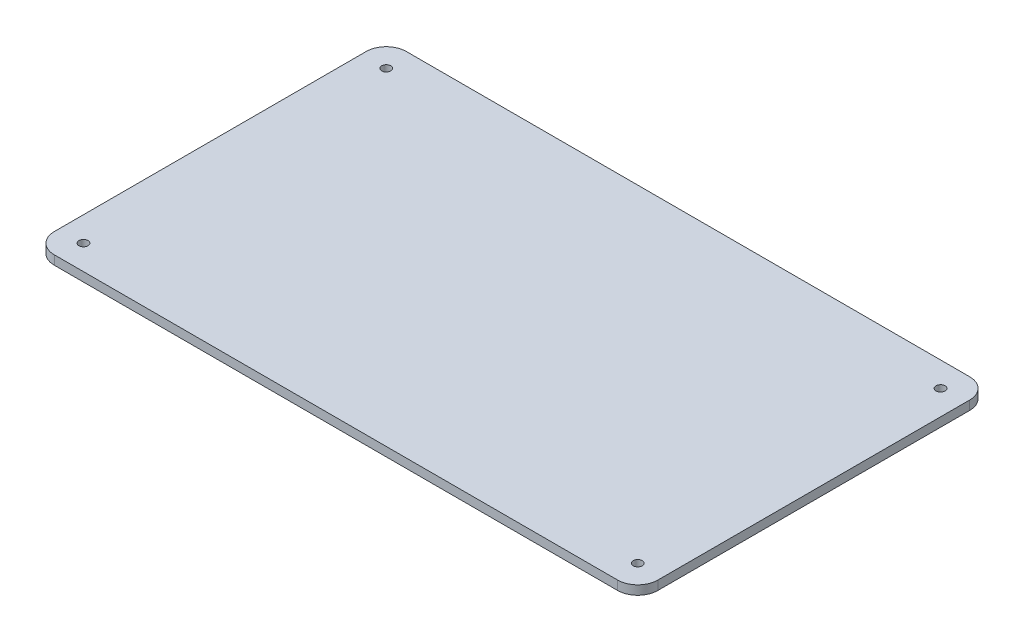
ISO-10303-21;
HEADER;
FILE_DESCRIPTION(('STEP AP214'),'2;1');
FILE_NAME('part.step','',(''),(''),'','','');
FILE_SCHEMA(('AUTOMOTIVE_DESIGN { 1 0 10303 214 1 1 1 1 }'));
ENDSEC;
DATA;
#1=APPLICATION_CONTEXT('core data for automotive mechanical design processes');
#2=APPLICATION_PROTOCOL_DEFINITION('international standard','automotive_design',2000,#1);
#3=PRODUCT_CONTEXT('',#1,'mechanical');
#4=PRODUCT('Part','Part','',(#3));
#5=PRODUCT_RELATED_PRODUCT_CATEGORY('part','',(#4));
#6=PRODUCT_DEFINITION_FORMATION('','',#4);
#7=PRODUCT_DEFINITION_CONTEXT('part definition',#1,'design');
#8=PRODUCT_DEFINITION('design','',#6,#7);
#9=PRODUCT_DEFINITION_SHAPE('','',#8);
#10=(LENGTH_UNIT() NAMED_UNIT(*) SI_UNIT(.MILLI.,.METRE.));
#11=(NAMED_UNIT(*) PLANE_ANGLE_UNIT() SI_UNIT($,.RADIAN.));
#12=(NAMED_UNIT(*) SI_UNIT($,.STERADIAN.) SOLID_ANGLE_UNIT());
#13=UNCERTAINTY_MEASURE_WITH_UNIT(LENGTH_MEASURE(1.E-05),#10,'distance_accuracy_value','');
#14=(GEOMETRIC_REPRESENTATION_CONTEXT(3) GLOBAL_UNCERTAINTY_ASSIGNED_CONTEXT((#13)) GLOBAL_UNIT_ASSIGNED_CONTEXT((#10,
#11,#12)) REPRESENTATION_CONTEXT('',''));
#15=CARTESIAN_POINT('',(0.,0.,0.));
#16=DIRECTION('',(0.,0.,1.));
#17=DIRECTION('',(1.,0.,0.));
#18=AXIS2_PLACEMENT_3D('',#15,#16,#17);
#19=CARTESIAN_POINT('',(140.,4.5,77.5));
#20=DIRECTION('',(0.,-1.,0.));
#21=DIRECTION('',(0.,0.,-1.));
#22=AXIS2_PLACEMENT_3D('',#19,#20,#21);
#23=CYLINDRICAL_SURFACE('',#22,10.);
#24=CARTESIAN_POINT('',(140.,0.,77.5));
#25=DIRECTION('',(0.,1.,0.));
#26=DIRECTION('',(0.,0.,1.));
#27=AXIS2_PLACEMENT_3D('',#24,#25,#26);
#28=CIRCLE('',#27,10.);
#29=CARTESIAN_POINT('',(140.,0.,87.5));
#30=VERTEX_POINT('',#29);
#31=CARTESIAN_POINT('',(150.,0.,77.5));
#32=VERTEX_POINT('',#31);
#33=EDGE_CURVE('E129',#30,#32,#28,.T.);
#34=ORIENTED_EDGE('',*,*,#33,.T.);
#35=DIRECTION('',(0.,-1.,0.));
#36=VECTOR('',#35,1.);
#37=CARTESIAN_POINT('',(150.,4.5,77.5));
#38=LINE('',#37,#36);
#39=CARTESIAN_POINT('',(150.,4.5,77.5));
#40=VERTEX_POINT('',#39);
#41=EDGE_CURVE('E11',#40,#32,#38,.T.);
#42=ORIENTED_EDGE('',*,*,#41,.F.);
#43=CARTESIAN_POINT('',(140.,4.5,77.5));
#44=DIRECTION('',(0.,1.,0.));
#45=DIRECTION('',(0.,0.,1.));
#46=AXIS2_PLACEMENT_3D('',#43,#44,#45);
#47=CIRCLE('',#46,10.);
#48=CARTESIAN_POINT('',(140.,4.5,87.5));
#49=VERTEX_POINT('',#48);
#50=EDGE_CURVE('E144',#49,#40,#47,.T.);
#51=ORIENTED_EDGE('',*,*,#50,.F.);
#52=DIRECTION('',(0.,-1.,0.));
#53=VECTOR('',#52,1.);
#54=CARTESIAN_POINT('',(140.,4.5,87.5));
#55=LINE('',#54,#53);
#56=EDGE_CURVE('E125',#49,#30,#55,.T.);
#57=ORIENTED_EDGE('',*,*,#56,.T.);
#58=EDGE_LOOP('',(#34,#42,#51,#57));
#59=FACE_BOUND('',#58,.T.);
#60=ADVANCED_FACE('F33',(#59),#23,.T.);
#61=CARTESIAN_POINT('',(150.,4.5,77.5));
#62=DIRECTION('',(-1.,0.,0.));
#63=DIRECTION('',(0.,0.,1.));
#64=AXIS2_PLACEMENT_3D('',#61,#62,#63);
#65=PLANE('',#64);
#66=DIRECTION('',(0.,0.,-1.));
#67=VECTOR('',#66,1.);
#68=CARTESIAN_POINT('',(150.,0.,77.5));
#69=LINE('',#68,#67);
#70=CARTESIAN_POINT('',(150.,0.,-77.5));
#71=VERTEX_POINT('',#70);
#72=EDGE_CURVE('E132',#32,#71,#69,.T.);
#73=ORIENTED_EDGE('',*,*,#72,.T.);
#74=DIRECTION('',(0.,-1.,0.));
#75=VECTOR('',#74,1.);
#76=CARTESIAN_POINT('',(150.,4.5,-77.5));
#77=LINE('',#76,#75);
#78=CARTESIAN_POINT('',(150.,4.5,-77.5));
#79=VERTEX_POINT('',#78);
#80=EDGE_CURVE('E41',#79,#71,#77,.T.);
#81=ORIENTED_EDGE('',*,*,#80,.F.);
#82=DIRECTION('',(0.,0.,-1.));
#83=VECTOR('',#82,1.);
#84=CARTESIAN_POINT('',(150.,4.5,77.5));
#85=LINE('',#84,#83);
#86=EDGE_CURVE('E92',#40,#79,#85,.T.);
#87=ORIENTED_EDGE('',*,*,#86,.F.);
#88=ORIENTED_EDGE('',*,*,#41,.T.);
#89=EDGE_LOOP('',(#73,#81,#87,#88));
#90=FACE_BOUND('',#89,.T.);
#91=ADVANCED_FACE('F230',(#90),#65,.F.);
#92=CARTESIAN_POINT('',(140.,4.5,-77.5));
#93=DIRECTION('',(0.,-1.,0.));
#94=DIRECTION('',(0.,0.,-1.));
#95=AXIS2_PLACEMENT_3D('',#92,#93,#94);
#96=CYLINDRICAL_SURFACE('',#95,10.);
#97=CARTESIAN_POINT('',(140.,0.,-77.5));
#98=DIRECTION('',(0.,1.,0.));
#99=DIRECTION('',(0.,0.,1.));
#100=AXIS2_PLACEMENT_3D('',#97,#98,#99);
#101=CIRCLE('',#100,10.);
#102=CARTESIAN_POINT('',(140.,0.,-87.5));
#103=VERTEX_POINT('',#102);
#104=EDGE_CURVE('E135',#71,#103,#101,.T.);
#105=ORIENTED_EDGE('',*,*,#104,.T.);
#106=DIRECTION('',(0.,-1.,0.));
#107=VECTOR('',#106,1.);
#108=CARTESIAN_POINT('',(140.,4.5,-87.5));
#109=LINE('',#108,#107);
#110=CARTESIAN_POINT('',(140.,4.5,-87.5));
#111=VERTEX_POINT('',#110);
#112=EDGE_CURVE('E151',#111,#103,#109,.T.);
#113=ORIENTED_EDGE('',*,*,#112,.F.);
#114=CARTESIAN_POINT('',(140.,4.5,-77.5));
#115=DIRECTION('',(0.,1.,0.));
#116=DIRECTION('',(0.,0.,1.));
#117=AXIS2_PLACEMENT_3D('',#114,#115,#116);
#118=CIRCLE('',#117,10.);
#119=EDGE_CURVE('E159',#79,#111,#118,.T.);
#120=ORIENTED_EDGE('',*,*,#119,.F.);
#121=ORIENTED_EDGE('',*,*,#80,.T.);
#122=EDGE_LOOP('',(#105,#113,#120,#121));
#123=FACE_BOUND('',#122,.T.);
#124=ADVANCED_FACE('F157',(#123),#96,.T.);
#125=CARTESIAN_POINT('',(140.,4.5,-87.5));
#126=DIRECTION('',(0.,0.,1.));
#127=DIRECTION('',(1.,0.,0.));
#128=AXIS2_PLACEMENT_3D('',#125,#126,#127);
#129=PLANE('',#128);
#130=DIRECTION('',(-1.,0.,0.));
#131=VECTOR('',#130,1.);
#132=CARTESIAN_POINT('',(140.,0.,-87.5));
#133=LINE('',#132,#131);
#134=CARTESIAN_POINT('',(-140.,0.,-87.5));
#135=VERTEX_POINT('',#134);
#136=EDGE_CURVE('E137',#103,#135,#133,.T.);
#137=ORIENTED_EDGE('',*,*,#136,.T.);
#138=DIRECTION('',(0.,-1.,0.));
#139=VECTOR('',#138,1.);
#140=CARTESIAN_POINT('',(-140.,4.5,-87.5));
#141=LINE('',#140,#139);
#142=CARTESIAN_POINT('',(-140.,4.5,-87.5));
#143=VERTEX_POINT('',#142);
#144=EDGE_CURVE('E148',#143,#135,#141,.T.);
#145=ORIENTED_EDGE('',*,*,#144,.F.);
#146=DIRECTION('',(-1.,0.,0.));
#147=VECTOR('',#146,1.);
#148=CARTESIAN_POINT('',(140.,4.5,-87.5));
#149=LINE('',#148,#147);
#150=EDGE_CURVE('E171',#111,#143,#149,.T.);
#151=ORIENTED_EDGE('',*,*,#150,.F.);
#152=ORIENTED_EDGE('',*,*,#112,.T.);
#153=EDGE_LOOP('',(#137,#145,#151,#152));
#154=FACE_BOUND('',#153,.T.);
#155=ADVANCED_FACE('F167',(#154),#129,.F.);
#156=CARTESIAN_POINT('',(-140.,4.5,-77.5));
#157=DIRECTION('',(0.,-1.,0.));
#158=DIRECTION('',(0.,0.,-1.));
#159=AXIS2_PLACEMENT_3D('',#156,#157,#158);
#160=CYLINDRICAL_SURFACE('',#159,10.);
#161=CARTESIAN_POINT('',(-140.,0.,-77.5));
#162=DIRECTION('',(0.,1.,0.));
#163=DIRECTION('',(0.,0.,1.));
#164=AXIS2_PLACEMENT_3D('',#161,#162,#163);
#165=CIRCLE('',#164,10.);
#166=CARTESIAN_POINT('',(-150.,0.,-77.5));
#167=VERTEX_POINT('',#166);
#168=EDGE_CURVE('E139',#135,#167,#165,.T.);
#169=ORIENTED_EDGE('',*,*,#168,.T.);
#170=DIRECTION('',(0.,-1.,0.));
#171=VECTOR('',#170,1.);
#172=CARTESIAN_POINT('',(-150.,4.5,-77.5));
#173=LINE('',#172,#171);
#174=CARTESIAN_POINT('',(-150.,4.5,-77.5));
#175=VERTEX_POINT('',#174);
#176=EDGE_CURVE('E120',#175,#167,#173,.T.);
#177=ORIENTED_EDGE('',*,*,#176,.F.);
#178=CARTESIAN_POINT('',(-140.,4.5,-77.5));
#179=DIRECTION('',(0.,1.,0.));
#180=DIRECTION('',(0.,0.,1.));
#181=AXIS2_PLACEMENT_3D('',#178,#179,#180);
#182=CIRCLE('',#181,10.);
#183=EDGE_CURVE('E111',#143,#175,#182,.T.);
#184=ORIENTED_EDGE('',*,*,#183,.F.);
#185=ORIENTED_EDGE('',*,*,#144,.T.);
#186=EDGE_LOOP('',(#169,#177,#184,#185));
#187=FACE_BOUND('',#186,.T.);
#188=ADVANCED_FACE('F170',(#187),#160,.T.);
#189=CARTESIAN_POINT('',(-150.,4.5,77.5));
#190=DIRECTION('',(1.,0.,0.));
#191=DIRECTION('',(0.,0.,-1.));
#192=AXIS2_PLACEMENT_3D('',#189,#190,#191);
#193=PLANE('',#192);
#194=DIRECTION('',(0.,0.,1.));
#195=VECTOR('',#194,1.);
#196=CARTESIAN_POINT('',(-150.,0.,77.5));
#197=LINE('',#196,#195);
#198=CARTESIAN_POINT('',(-150.,0.,77.5));
#199=VERTEX_POINT('',#198);
#200=EDGE_CURVE('E119',#167,#199,#197,.T.);
#201=ORIENTED_EDGE('',*,*,#200,.T.);
#202=DIRECTION('',(0.,-1.,0.));
#203=VECTOR('',#202,1.);
#204=CARTESIAN_POINT('',(-150.,4.5,77.5));
#205=LINE('',#204,#203);
#206=CARTESIAN_POINT('',(-150.,4.5,77.5));
#207=VERTEX_POINT('',#206);
#208=EDGE_CURVE('E116',#207,#199,#205,.T.);
#209=ORIENTED_EDGE('',*,*,#208,.F.);
#210=DIRECTION('',(0.,0.,1.));
#211=VECTOR('',#210,1.);
#212=CARTESIAN_POINT('',(-150.,4.5,77.5));
#213=LINE('',#212,#211);
#214=EDGE_CURVE('E105',#175,#207,#213,.T.);
#215=ORIENTED_EDGE('',*,*,#214,.F.);
#216=ORIENTED_EDGE('',*,*,#176,.T.);
#217=EDGE_LOOP('',(#201,#209,#215,#216));
#218=FACE_BOUND('',#217,.T.);
#219=ADVANCED_FACE('F117',(#218),#193,.F.);
#220=CARTESIAN_POINT('',(-140.,4.5,77.5));
#221=DIRECTION('',(0.,-1.,0.));
#222=DIRECTION('',(0.,0.,-1.));
#223=AXIS2_PLACEMENT_3D('',#220,#221,#222);
#224=CYLINDRICAL_SURFACE('',#223,10.);
#225=CARTESIAN_POINT('',(-140.,0.,77.5));
#226=DIRECTION('',(0.,1.,0.));
#227=DIRECTION('',(0.,0.,-1.));
#228=AXIS2_PLACEMENT_3D('',#225,#226,#227);
#229=CIRCLE('',#228,10.);
#230=CARTESIAN_POINT('',(-140.,0.,87.5));
#231=VERTEX_POINT('',#230);
#232=EDGE_CURVE('E78',#199,#231,#229,.T.);
#233=ORIENTED_EDGE('',*,*,#232,.T.);
#234=DIRECTION('',(0.,-1.,0.));
#235=VECTOR('',#234,1.);
#236=CARTESIAN_POINT('',(-140.,4.5,87.5));
#237=LINE('',#236,#235);
#238=CARTESIAN_POINT('',(-140.,4.5,87.5));
#239=VERTEX_POINT('',#238);
#240=EDGE_CURVE('E121',#239,#231,#237,.T.);
#241=ORIENTED_EDGE('',*,*,#240,.F.);
#242=CARTESIAN_POINT('',(-140.,4.5,77.5));
#243=DIRECTION('',(0.,1.,0.));
#244=DIRECTION('',(0.,0.,-1.));
#245=AXIS2_PLACEMENT_3D('',#242,#243,#244);
#246=CIRCLE('',#245,10.);
#247=EDGE_CURVE('E109',#207,#239,#246,.T.);
#248=ORIENTED_EDGE('',*,*,#247,.F.);
#249=ORIENTED_EDGE('',*,*,#208,.T.);
#250=EDGE_LOOP('',(#233,#241,#248,#249));
#251=FACE_BOUND('',#250,.T.);
#252=ADVANCED_FACE('F123',(#251),#224,.T.);
#253=CARTESIAN_POINT('',(140.,4.5,87.5));
#254=DIRECTION('',(0.,0.,-1.));
#255=DIRECTION('',(-1.,0.,0.));
#256=AXIS2_PLACEMENT_3D('',#253,#254,#255);
#257=PLANE('',#256);
#258=DIRECTION('',(1.,0.,0.));
#259=VECTOR('',#258,1.);
#260=CARTESIAN_POINT('',(140.,0.,87.5));
#261=LINE('',#260,#259);
#262=EDGE_CURVE('E84',#231,#30,#261,.T.);
#263=ORIENTED_EDGE('',*,*,#262,.T.);
#264=ORIENTED_EDGE('',*,*,#56,.F.);
#265=DIRECTION('',(1.,0.,0.));
#266=VECTOR('',#265,1.);
#267=CARTESIAN_POINT('',(140.,4.5,87.5));
#268=LINE('',#267,#266);
#269=EDGE_CURVE('E49',#239,#49,#268,.T.);
#270=ORIENTED_EDGE('',*,*,#269,.F.);
#271=ORIENTED_EDGE('',*,*,#240,.T.);
#272=EDGE_LOOP('',(#263,#264,#270,#271));
#273=FACE_BOUND('',#272,.T.);
#274=ADVANCED_FACE('F205',(#273),#257,.F.);
#275=CARTESIAN_POINT('',(140.,4.5,77.5));
#276=DIRECTION('',(0.,1.,0.));
#277=DIRECTION('',(0.,0.,1.));
#278=AXIS2_PLACEMENT_3D('',#275,#276,#277);
#279=PLANE('',#278);
#280=CARTESIAN_POINT('',(-137.75,4.5,-75.25));
#281=DIRECTION('',(0.,1.,0.));
#282=DIRECTION('',(0.,0.,1.));
#283=AXIS2_PLACEMENT_3D('',#280,#281,#282);
#284=CIRCLE('',#283,2.25);
#285=CARTESIAN_POINT('',(-137.75,4.5,-73.));
#286=VERTEX_POINT('',#285);
#287=EDGE_CURVE('E197',#286,#286,#284,.T.);
#288=ORIENTED_EDGE('',*,*,#287,.F.);
#289=EDGE_LOOP('',(#288));
#290=FACE_BOUND('',#289,.T.);
#291=CARTESIAN_POINT('',(137.75,4.5,-75.25));
#292=DIRECTION('',(0.,1.,0.));
#293=DIRECTION('',(0.,0.,1.));
#294=AXIS2_PLACEMENT_3D('',#291,#292,#293);
#295=CIRCLE('',#294,2.25);
#296=CARTESIAN_POINT('',(137.75,4.5,-73.));
#297=VERTEX_POINT('',#296);
#298=EDGE_CURVE('E191',#297,#297,#295,.T.);
#299=ORIENTED_EDGE('',*,*,#298,.F.);
#300=EDGE_LOOP('',(#299));
#301=FACE_BOUND('',#300,.T.);
#302=CARTESIAN_POINT('',(137.75,4.5,75.25));
#303=DIRECTION('',(0.,1.,0.));
#304=DIRECTION('',(0.,0.,1.));
#305=AXIS2_PLACEMENT_3D('',#302,#303,#304);
#306=CIRCLE('',#305,2.25);
#307=CARTESIAN_POINT('',(137.75,4.5,77.5));
#308=VERTEX_POINT('',#307);
#309=EDGE_CURVE('E185',#308,#308,#306,.T.);
#310=ORIENTED_EDGE('',*,*,#309,.F.);
#311=EDGE_LOOP('',(#310));
#312=FACE_BOUND('',#311,.T.);
#313=CARTESIAN_POINT('',(-137.75,4.5,75.25));
#314=DIRECTION('',(0.,1.,0.));
#315=DIRECTION('',(0.,0.,1.));
#316=AXIS2_PLACEMENT_3D('',#313,#314,#315);
#317=CIRCLE('',#316,2.25);
#318=CARTESIAN_POINT('',(-137.75,4.5,77.5));
#319=VERTEX_POINT('',#318);
#320=EDGE_CURVE('E179',#319,#319,#317,.T.);
#321=ORIENTED_EDGE('',*,*,#320,.F.);
#322=EDGE_LOOP('',(#321));
#323=FACE_BOUND('',#322,.T.);
#324=ORIENTED_EDGE('',*,*,#50,.T.);
#325=ORIENTED_EDGE('',*,*,#86,.T.);
#326=ORIENTED_EDGE('',*,*,#119,.T.);
#327=ORIENTED_EDGE('',*,*,#150,.T.);
#328=ORIENTED_EDGE('',*,*,#183,.T.);
#329=ORIENTED_EDGE('',*,*,#214,.T.);
#330=ORIENTED_EDGE('',*,*,#247,.T.);
#331=ORIENTED_EDGE('',*,*,#269,.T.);
#332=EDGE_LOOP('',(#324,#325,#326,#327,#328,#329,#330,#331));
#333=FACE_BOUND('',#332,.T.);
#334=ADVANCED_FACE('F107',(#290,#301,#312,#323,#333),#279,.T.);
#335=CARTESIAN_POINT('',(140.,0.,77.5));
#336=DIRECTION('',(0.,1.,0.));
#337=DIRECTION('',(0.,0.,1.));
#338=AXIS2_PLACEMENT_3D('',#335,#336,#337);
#339=PLANE('',#338);
#340=CARTESIAN_POINT('',(-137.75,0.,-75.25));
#341=DIRECTION('',(0.,1.,0.));
#342=DIRECTION('',(0.,0.,1.));
#343=AXIS2_PLACEMENT_3D('',#340,#341,#342);
#344=CIRCLE('',#343,2.25);
#345=CARTESIAN_POINT('',(-137.75,0.,-73.));
#346=VERTEX_POINT('',#345);
#347=EDGE_CURVE('E194',#346,#346,#344,.T.);
#348=ORIENTED_EDGE('',*,*,#347,.T.);
#349=EDGE_LOOP('',(#348));
#350=FACE_BOUND('',#349,.T.);
#351=CARTESIAN_POINT('',(137.75,0.,-75.25));
#352=DIRECTION('',(0.,1.,0.));
#353=DIRECTION('',(0.,0.,1.));
#354=AXIS2_PLACEMENT_3D('',#351,#352,#353);
#355=CIRCLE('',#354,2.25);
#356=CARTESIAN_POINT('',(137.75,0.,-73.));
#357=VERTEX_POINT('',#356);
#358=EDGE_CURVE('E188',#357,#357,#355,.T.);
#359=ORIENTED_EDGE('',*,*,#358,.T.);
#360=EDGE_LOOP('',(#359));
#361=FACE_BOUND('',#360,.T.);
#362=CARTESIAN_POINT('',(137.75,0.,75.25));
#363=DIRECTION('',(0.,1.,0.));
#364=DIRECTION('',(0.,0.,1.));
#365=AXIS2_PLACEMENT_3D('',#362,#363,#364);
#366=CIRCLE('',#365,2.25);
#367=CARTESIAN_POINT('',(137.75,0.,77.5));
#368=VERTEX_POINT('',#367);
#369=EDGE_CURVE('E182',#368,#368,#366,.T.);
#370=ORIENTED_EDGE('',*,*,#369,.T.);
#371=EDGE_LOOP('',(#370));
#372=FACE_BOUND('',#371,.T.);
#373=CARTESIAN_POINT('',(-137.75,0.,75.25));
#374=DIRECTION('',(0.,1.,0.));
#375=DIRECTION('',(0.,0.,1.));
#376=AXIS2_PLACEMENT_3D('',#373,#374,#375);
#377=CIRCLE('',#376,2.25);
#378=CARTESIAN_POINT('',(-137.75,0.,77.5));
#379=VERTEX_POINT('',#378);
#380=EDGE_CURVE('E133',#379,#379,#377,.T.);
#381=ORIENTED_EDGE('',*,*,#380,.T.);
#382=EDGE_LOOP('',(#381));
#383=FACE_BOUND('',#382,.T.);
#384=ORIENTED_EDGE('',*,*,#33,.F.);
#385=ORIENTED_EDGE('',*,*,#262,.F.);
#386=ORIENTED_EDGE('',*,*,#232,.F.);
#387=ORIENTED_EDGE('',*,*,#200,.F.);
#388=ORIENTED_EDGE('',*,*,#168,.F.);
#389=ORIENTED_EDGE('',*,*,#136,.F.);
#390=ORIENTED_EDGE('',*,*,#104,.F.);
#391=ORIENTED_EDGE('',*,*,#72,.F.);
#392=EDGE_LOOP('',(#384,#385,#386,#387,#388,#389,#390,#391));
#393=FACE_BOUND('',#392,.T.);
#394=ADVANCED_FACE('F163',(#350,#361,#372,#383,#393),#339,.F.);
#395=CARTESIAN_POINT('',(-137.75,4.5,75.25));
#396=DIRECTION('',(0.,1.,0.));
#397=DIRECTION('',(0.,0.,1.));
#398=AXIS2_PLACEMENT_3D('',#395,#396,#397);
#399=CYLINDRICAL_SURFACE('',#398,2.25);
#400=ORIENTED_EDGE('',*,*,#380,.F.);
#401=EDGE_LOOP('',(#400));
#402=FACE_BOUND('',#401,.T.);
#403=ORIENTED_EDGE('',*,*,#320,.T.);
#404=EDGE_LOOP('',(#403));
#405=FACE_BOUND('',#404,.T.);
#406=ADVANCED_FACE('F213',(#402,#405),#399,.F.);
#407=CARTESIAN_POINT('',(137.75,4.5,75.25));
#408=DIRECTION('',(0.,1.,0.));
#409=DIRECTION('',(0.,0.,1.));
#410=AXIS2_PLACEMENT_3D('',#407,#408,#409);
#411=CYLINDRICAL_SURFACE('',#410,2.25);
#412=ORIENTED_EDGE('',*,*,#369,.F.);
#413=EDGE_LOOP('',(#412));
#414=FACE_BOUND('',#413,.T.);
#415=ORIENTED_EDGE('',*,*,#309,.T.);
#416=EDGE_LOOP('',(#415));
#417=FACE_BOUND('',#416,.T.);
#418=ADVANCED_FACE('F215',(#414,#417),#411,.F.);
#419=CARTESIAN_POINT('',(137.75,4.5,-75.25));
#420=DIRECTION('',(0.,1.,0.));
#421=DIRECTION('',(0.,0.,1.));
#422=AXIS2_PLACEMENT_3D('',#419,#420,#421);
#423=CYLINDRICAL_SURFACE('',#422,2.25);
#424=ORIENTED_EDGE('',*,*,#358,.F.);
#425=EDGE_LOOP('',(#424));
#426=FACE_BOUND('',#425,.T.);
#427=ORIENTED_EDGE('',*,*,#298,.T.);
#428=EDGE_LOOP('',(#427));
#429=FACE_BOUND('',#428,.T.);
#430=ADVANCED_FACE('F222',(#426,#429),#423,.F.);
#431=CARTESIAN_POINT('',(-137.75,4.5,-75.25));
#432=DIRECTION('',(0.,1.,0.));
#433=DIRECTION('',(0.,0.,1.));
#434=AXIS2_PLACEMENT_3D('',#431,#432,#433);
#435=CYLINDRICAL_SURFACE('',#434,2.25);
#436=ORIENTED_EDGE('',*,*,#347,.F.);
#437=EDGE_LOOP('',(#436));
#438=FACE_BOUND('',#437,.T.);
#439=ORIENTED_EDGE('',*,*,#287,.T.);
#440=EDGE_LOOP('',(#439));
#441=FACE_BOUND('',#440,.T.);
#442=ADVANCED_FACE('F201',(#438,#441),#435,.F.);
#443=CLOSED_SHELL('',(#60,#91,#124,#155,#188,#219,#252,#274,#334,#394,#406,#418,#430,#442));
#444=MANIFOLD_SOLID_BREP('B2',#443);
#445=ADVANCED_BREP_SHAPE_REPRESENTATION('',(#18,#444),#14);
#446=SHAPE_DEFINITION_REPRESENTATION(#9,#445);
ENDSEC;
END-ISO-10303-21;
